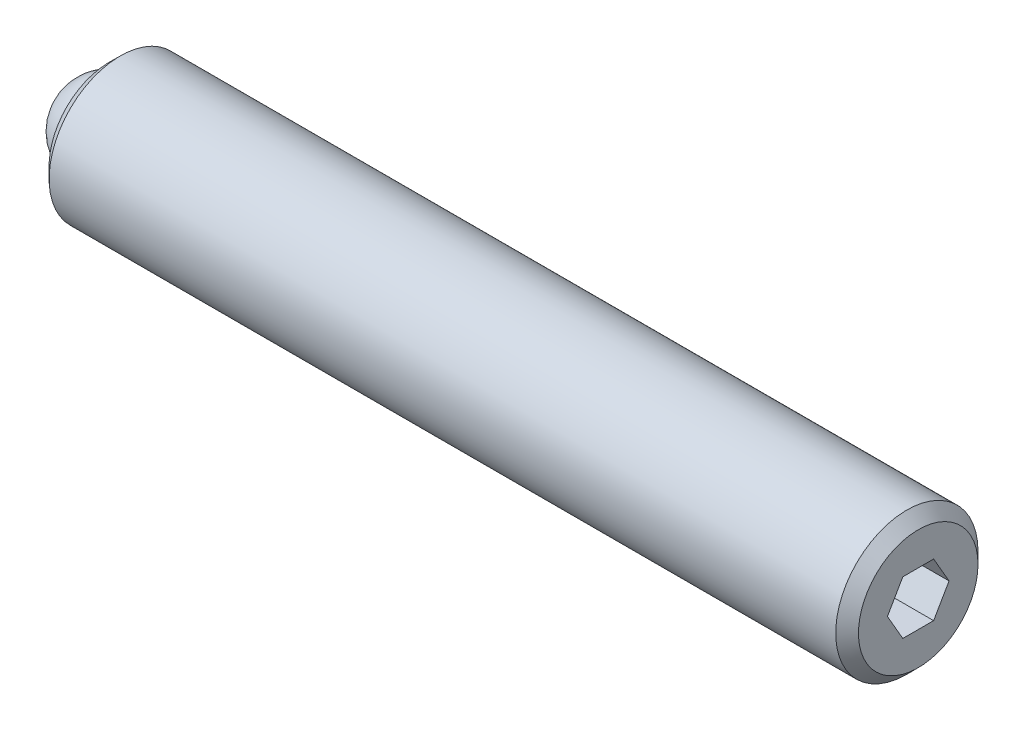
from build123d import *

# Parameters (mm, degrees)
SKETCH2_R           = 3.175
BOSS_EXTRUDE1_DEPTH = 36.115625
CHAMFER1_SIZE       = 0.508
CHAMFER2_SIZE       = 0.508
CUT_EXTRUDE2_DEPTH  = 2.286
SKETCH3_R           = 1.9812
CUT_EXTRUDE3_DEPTH  = 1.984375


with BuildPart() as part:
    # Sketch2 → Boss-Extrude1 (new body)
    with BuildSketch(Plane(origin=(0, 0, 0), x_dir=(0, 0, -1), z_dir=(1, 0, 0))):
        Circle(SKETCH2_R)
    extrude(amount=BOSS_EXTRUDE1_DEPTH)

    # Chamfer1
    chamfer1_edges = [part.edges().sort_by_distance(p)[0] for p in [
        (0, 0, 3.175),
    ]]
    chamfer(chamfer1_edges, length=CHAMFER1_SIZE)

    # Chamfer2
    chamfer2_edges = [part.edges().sort_by_distance(p)[0] for p in [
        (36.115625, 0, 3.175),
    ]]
    chamfer(chamfer2_edges, length=CHAMFER2_SIZE)

    # Sketch4 → Cut-Extrude2 (cut)
    with BuildSketch(Plane(origin=(36.115625, 0, 0), x_dir=(0, 0, -1), z_dir=(1, 0, 0))):
        Polygon((1.374815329, 0), (0.687407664, 1.190625), (-0.687407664, 1.190625), (-1.374815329, 0), (-0.687407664, -1.190625), (0.687407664, -1.190625), align=None)
    extrude(amount=-CUT_EXTRUDE2_DEPTH, mode=Mode.SUBTRACT)

    # Sketch3 → Cut-Extrude3 (cut)
    with BuildSketch(Plane.ZY):
        Circle(SKETCH3_R)
    extrude(amount=-CUT_EXTRUDE3_DEPTH, mode=Mode.SUBTRACT)


with BuildPart() as body_2:
    # Sketch5 → Revolve1 (revolve)
    with BuildSketch(Plane.ZY):
        with BuildLine():
            Line((0, 0), (0, -1.984375))
            ThreePointArc((0, -1.984375), (-1.984375, 0), (0, 1.984375))
            Line((0, 1.984375), (0, 0))
        make_face()
    revolve(axis=Axis((0, 0, 0), (0, 1, 0)))


solid = Compound([part.part, body_2.part])
